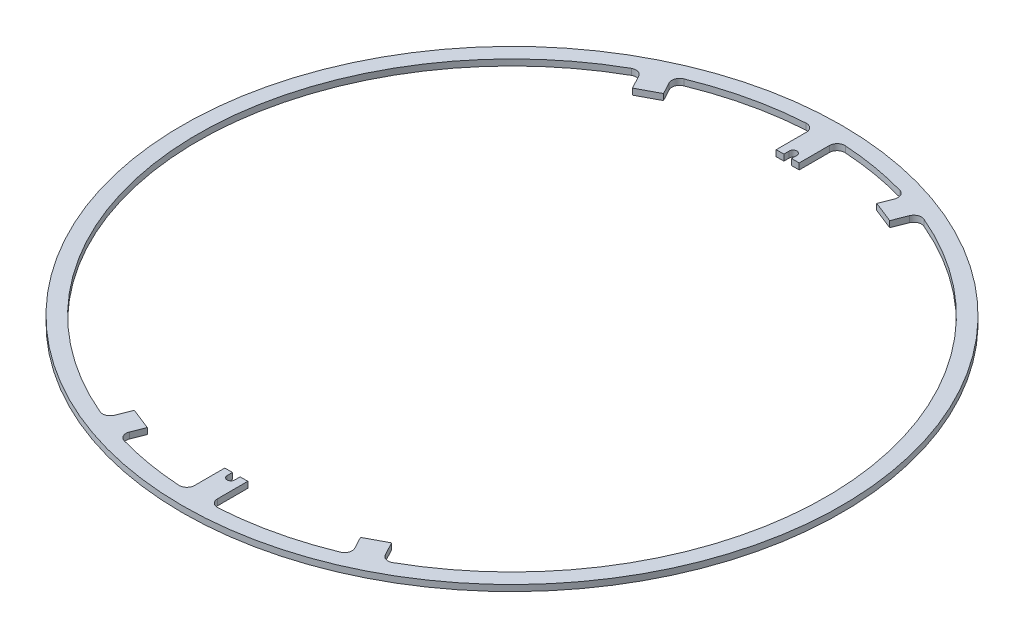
from build123d import *

# Parameters (mm, degrees)
SKETCH_1_R          = 43
SKETCH_1_R_2        = 41
EXTRUDE_1_DEPTH     = 0.8
EXTRUDE_START       = -0.8
EXTRUDE_2_DEPTH     = 0.8
FILLET_1_R          = 1
FILLET_2_R          = 1
CUT_EXTRUDE_1_DEPTH = 61.816445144
EXTRUDE_3_DEPTH     = 0.8
FILLET_3_R          = 1
EXTRUDE_4_DEPTH     = 0.8
FILLET_4_R          = 1


with BuildPart() as part:
    # Sketch 1 → Extrude 1 (new body)
    with BuildSketch(Plane(origin=(0, 0, 0), x_dir=(1, 0, 0), z_dir=(0, 1, 0))):
        with Locations(Location((0, 0, 0), (0, 0, 270))):
            Circle(SKETCH_1_R)
        with Locations(Location((0, 0, 0), (0, 0, 270))):
            Circle(SKETCH_1_R_2, mode=Mode.SUBTRACT)
    extrude(amount=EXTRUDE_1_DEPTH)

    # Sketch 2 → Extrude 2 (add)
    with BuildSketch(Plane(origin=(0, 0.8, 0), x_dir=(1, 0, 0), z_dir=(0, 1, 0)).offset(EXTRUDE_START)):
        with BuildLine():
            Line((-1.5, -35.972551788), (-1.5, -40.972551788))
            ThreePointArc((-1.5, -40.972551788), (0, -41), (1.5, -40.972551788))
            Line((1.5, -40.972551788), (1.5, -35.972551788))
            Line((1.5, -35.972551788), (-1.5, -35.972551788))
        make_face()
        with BuildLine():
            ThreePointArc((1.5, 40.972551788), (0, 41), (-1.5, 40.972551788))
            Line((-1.5, 40.972551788), (-1.5, 35.972551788))
            Line((-1.5, 35.972551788), (1.5, 35.972551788))
            Line((1.5, 35.972551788), (1.5, 40.972551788))
        make_face()
    extrude(amount=EXTRUDE_2_DEPTH)

    # Fillet 1
    fillet_1_edges = [part.edges().sort_by_distance(p)[0] for p in [
        (-1.5, 0.4, -40.972551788),
        (1.5, 0.4, -40.972551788),
    ]]
    fillet(fillet_1_edges, radius=FILLET_1_R)

    # Fillet 2
    fillet_2_edges = [part.edges().sort_by_distance(p)[0] for p in [
        (-1.5, 0.4, 40.972551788),
        (1.5, 0.4, 40.972551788),
    ]]
    fillet(fillet_2_edges, radius=FILLET_2_R)

    # Sketch 3 → Cut-Extrude 1 (cut, through all)
    with BuildSketch(Plane.XZ):
        with BuildLine():
            Line((-0.5, 36.672551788), (-0.5, 33.672551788))
            Line((-0.5, 33.672551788), (0.5, 33.672551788))
            Line((0.5, 33.672551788), (0.5, 36.672551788))
            ThreePointArc((0.5, 36.672551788), (0, 37.172551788), (-0.5, 36.672551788))
        make_face()
        with BuildLine():
            Line((0.5, -33.672551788), (0.5, -36.672551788))
            ThreePointArc((0.5, -36.672551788), (0, -37.172551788), (-0.5, -36.672551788))
            Line((-0.5, -36.672551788), (-0.5, -33.672551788))
            Line((-0.5, -33.672551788), (0.5, -33.672551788))
        make_face()
    extrude(amount=-CUT_EXTRUDE_1_DEPTH, mode=Mode.SUBTRACT)

    # Sketch 4 → Extrude 3 (add)
    with BuildSketch(Plane(origin=(0, 0.8, 0), x_dir=(1, 0, 0), z_dir=(0, 1, 0)).offset(EXTRUDE_START)):
        with BuildLine():
            Line((-15.026550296, -38.147120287), (-13.927046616, -35.355867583))
            Line((-13.927046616, -35.355867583), (-11.135793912, -36.455371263))
            Line((-11.135793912, -36.455371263), (-12.195017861, -39.144367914))
            ThreePointArc((-12.195017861, -39.144367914), (-13.619914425, -38.671668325), (-15.026550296, -38.147120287))
        make_face()
        with BuildLine():
            Line((15.026550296, 38.147120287), (13.927046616, 35.355867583))
            Line((13.927046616, 35.355867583), (11.135793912, 36.455371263))
            Line((11.135793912, 36.455371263), (12.195017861, 39.144367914))
            ThreePointArc((12.195017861, 39.144367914), (13.619914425, 38.671668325), (15.026550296, 38.147120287))
        make_face()
    extrude(amount=EXTRUDE_3_DEPTH)

    # Fillet 3
    fillet_3_edges = [part.edges().sort_by_distance(p)[0] for p in [
        (-12.195017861, 0.4, 39.144367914),
        (-15.026550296, 0.4, 38.147120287),
        (12.195017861, 0.4, -39.144367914),
        (15.026550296, 0.4, -38.147120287),
    ]]
    fillet(fillet_3_edges, radius=FILLET_3_R)

    # Sketch 5 → Extrude 4 (add)
    with BuildSketch(Plane.XZ):
        with BuildLine():
            Line((19.248334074, 36.200851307), (17.839919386, 33.552008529))
            Line((17.839919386, 33.552008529), (15.191076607, 34.960423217))
            Line((15.191076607, 34.960423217), (16.547894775, 37.512227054))
            ThreePointArc((16.547894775, 37.512227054), (17.910120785, 36.881263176), (19.248334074, 36.200851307))
        make_face()
        with BuildLine():
            Line((-15.191076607, -34.960423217), (-16.547894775, -37.512227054))
            ThreePointArc((-16.547894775, -37.512227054), (-17.910120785, -36.881263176), (-19.248334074, -36.200851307))
            Line((-19.248334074, -36.200851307), (-17.839919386, -33.552008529))
            Line((-17.839919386, -33.552008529), (-15.191076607, -34.960423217))
        make_face()
    extrude(amount=-EXTRUDE_4_DEPTH)

    # Fillet 4
    fillet_4_edges = [part.edges().sort_by_distance(p)[0] for p in [
        (19.248334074, 0.4, 36.200851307),
        (16.547894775, 0.4, 37.512227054),
        (-19.248334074, 0.4, -36.200851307),
        (-16.547894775, 0.4, -37.512227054),
    ]]
    fillet(fillet_4_edges, radius=FILLET_4_R)


solid = part.part
